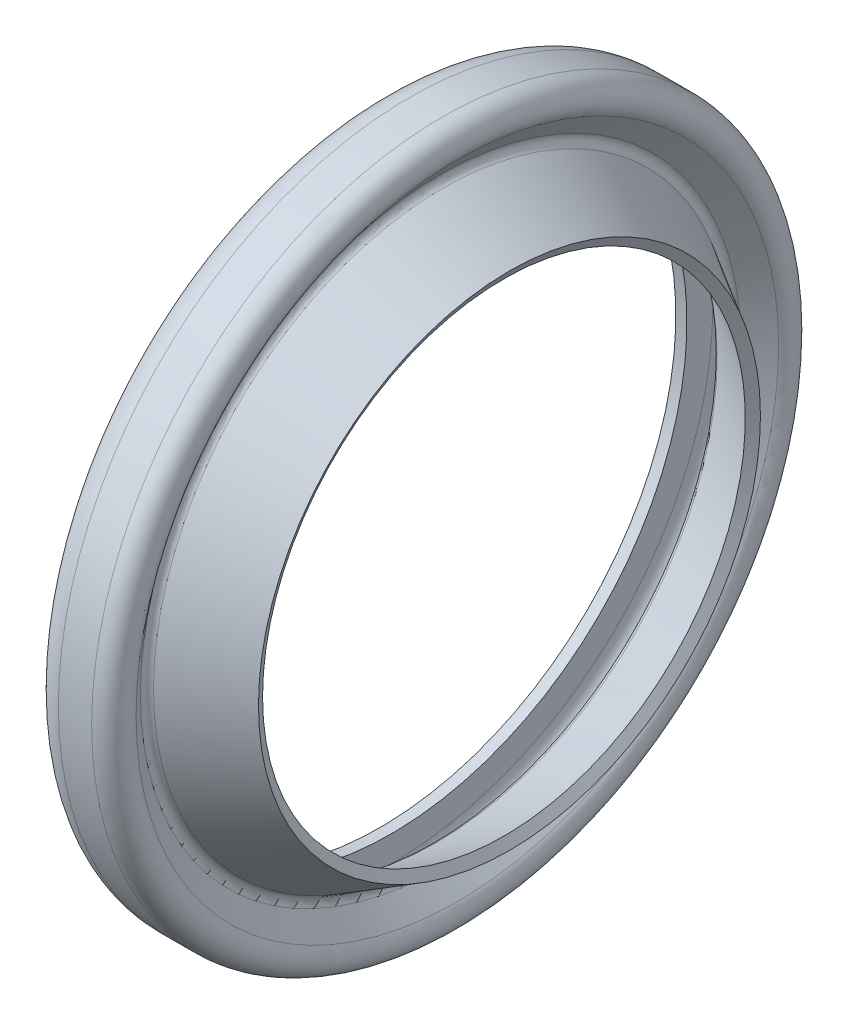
from build123d import *


with BuildPart() as part:
    # Esquisse1 → R_volution1 (revolve)
    with BuildSketch(Plane.XY, mode=Mode.PRIVATE) as r_volution1_sk:
        with BuildLine():
            Line((0, 80), (0, 87))
            ThreePointArc((0, 87), (2.343145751, 92.656854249), (8, 95))
            Line((8, 95), (17, 95))
            ThreePointArc((17, 95), (21.502321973, 92.174648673), (20.916387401, 86.89163874))
            Line((20.916387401, 86.89163874), (16.433445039, 81.243344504))
            ThreePointArc((16.433445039, 81.243344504), (16.035300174, 79.625894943), (17, 78.267949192))
            Line((17, 78.267949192), (35, 67.875644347))
            Line((35, 67.875644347), (33.5, 65.277568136))
            Line((33.5, 65.277568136), (15.5, 75.669872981))
            ThreePointArc((15.5, 75.669872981), (13.088250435, 79.064737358), (14.083612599, 83.10836126))
            Line((14.083612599, 83.10836126), (18.566554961, 88.756655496))
            ThreePointArc((18.566554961, 88.756655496), (18.800928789, 90.869859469), (17, 92))
            Line((17, 92), (8, 92))
            ThreePointArc((8, 92), (4.464466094, 90.535533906), (3, 87))
            Line((3, 87), (3, 80))
            Line((3, 80), (0, 80))
        make_face()
    revolve(r_volution1_sk.sketch.rotate(Axis((0, 0, 0), (1, 0, 0)), 90), axis=Axis((0, 0, 0), (1, 0, 0)))


solid = part.part
